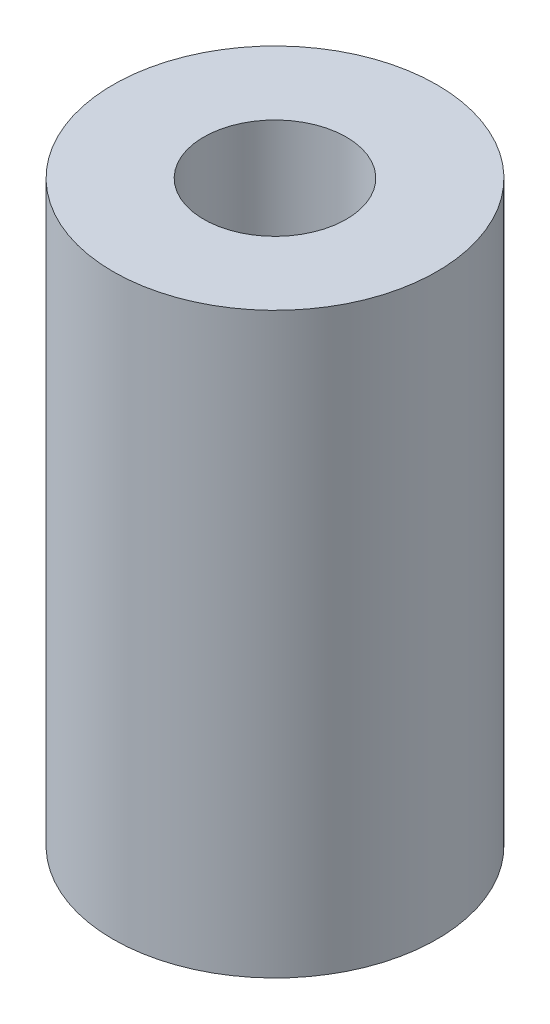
from build123d import *

# Parameters (mm, degrees)
SKETCH1_R     = 5.334
SKETCH1_R_2   = 2.3495
MAGBODY_DEPTH = 19.05


with BuildPart() as part:
    # Sketch1 → MagBody (new body)
    with BuildSketch(Plane(origin=(0, 0, 0), x_dir=(1, 0, 0), z_dir=(0, 1, 0))):
        with Locations(Location((0, 0, 0), (0, 0, 90))):
            Circle(SKETCH1_R)
        with Locations(Location((0, 0, 0), (0, 0, 90))):
            Circle(SKETCH1_R_2, mode=Mode.SUBTRACT)
    extrude(amount=MAGBODY_DEPTH)


solid = part.part
